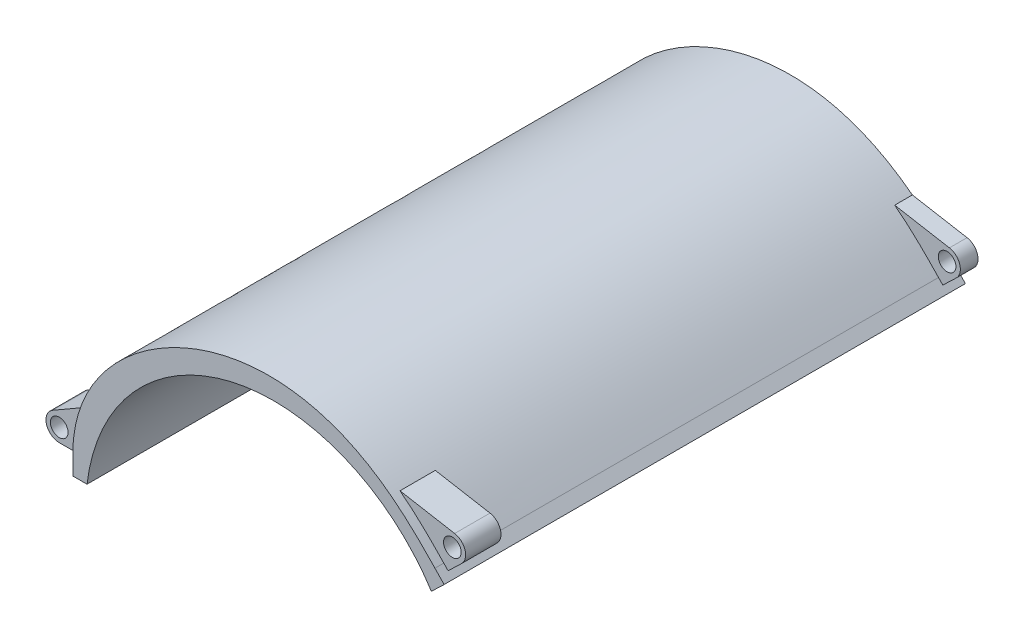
from build123d import *

# Parameters (mm, degrees)
BOSS_EXTRUDE1_DEPTH = 295
BOSS_EXTRUDE2_START = 285
SKETCH3_R           = 10
BOSS_EXTRUDE2_DEPTH = 40
BOSS_EXTRUDE3_START = -275
SKETCH3_4_R         = 10
BOSS_EXTRUDE3_DEPTH = 20


with BuildPart() as part:
    # Sketch1 → Boss-Extrude1 (new, symmetric)
    with BuildSketch(Plane.XY):
        with BuildLine():
            Line((-59.323974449, 128.759639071), (-73.741375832, 114.898234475))
            ThreePointArc((-73.741375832, 114.898234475), (-300.256584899, 207.064141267), (-463.524287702, 25))
            Line((-463.524287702, 25), (-479.524287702, 25))
            Line((-479.524287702, 25), (-479.524287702, 50))
            add(Edge.make_bspline(
                [(-69.720027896, 139.572690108), (-108.18754722, 179.583185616), (-152.416815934, 225.586540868), (-219.133886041, 251.435560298), (-287.408844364, 253.328836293), (-359.356081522, 236.563554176), (-477.15378099, 170.567422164), (-479.524287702, 50)],
                knots=[0, 0, 0, 0, 0, 0, 0, 0, 1, 1, 1, 1, 1, 1, 1, 1], degree=7))
            Line((-69.720027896, 139.572690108), (-59.323974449, 128.759639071))
        make_face()
    extrude(amount=BOSS_EXTRUDE1_DEPTH, both=True)

    # Sketch3 → Boss-Extrude2 (add)
    # profile 1 of 2: a face of its own
    with BuildSketch(Plane.XY.offset(BOSS_EXTRUDE2_START)):
        with BuildLine():
            Line((-505, 40), (-479.524287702, 40))
            Line((-479.524287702, 40), (-479.524287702, 50.000000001))
            add(Edge.make_bspline(
                [(-472.826933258, 90.89563682), (-474.51705784, 85.487785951), (-475.993797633, 79.937195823), (-477.239796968, 74.242499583), (-478.236465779, 68.402452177), (-478.963896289, 62.415949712), (-479.400774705, 56.282050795), (-479.524287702, 50.000000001)],
                knots=[0.947895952, 0.947895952, 0.947895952, 0.947895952, 0.947895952, 0.947895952, 0.947895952, 0.947895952, 1, 1, 1, 1, 1, 1, 1, 1], degree=7))
            Line((-472.826933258, 90.89563682), (-512.5, 67.990381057))
            ThreePointArc((-512.5, 67.990381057), (-519.488887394, 51.117714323), (-505, 40))
        make_face()
        with Locations((-505, 55)):
            Circle(SKETCH3_R, mode=Mode.SUBTRACT)
    # profile 2 of 2: a face of its own
    with BuildSketch(Plane.XY.offset(BOSS_EXTRUDE2_START)):
        with BuildLine():
            Line((-49.603946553, 149.186948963), (-64.860756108, 134.518507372))
            Line((-64.860756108, 134.518507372), (-69.720027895, 139.572690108))
            add(Edge.make_bspline(
                [(-69.720027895, 139.572690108), (-76.074149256, 146.181682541), (-82.585479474, 152.954189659), (-89.329402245, 159.772367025), (-96.35326765, 166.535005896), (-103.683856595, 173.155904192), (-111.333957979, 179.561593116), (-119.307330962, 185.688881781)],
                knots=[0, 0, 0, 0, 0, 0, 0, 0, 0.165181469, 0.165181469, 0.165181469, 0.165181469, 0.165181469, 0.165181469, 0.165181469, 0.165181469], degree=7))
            Line((-119.307330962, 185.688881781), (-57.395277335, 174.772116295))
            ThreePointArc((-57.395277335, 174.772116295), (-45.650601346, 164.369754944), (-49.603946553, 149.186948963))
        make_face()
        with Locations((-60, 160)):
            Circle(SKETCH3_R, mode=Mode.SUBTRACT)
    extrude(amount=-BOSS_EXTRUDE2_DEPTH)

    # Sketch3_4 → Boss-Extrude3 (add)
    # profile 1 of 2: a face of its own
    with BuildSketch(Plane.XY.offset(BOSS_EXTRUDE3_START)):
        with BuildLine():
            Line((-505, 40), (-479.524287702, 40))
            Line((-479.524287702, 40), (-479.524287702, 50.000000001))
            add(Edge.make_bspline(
                [(-472.826933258, 90.89563682), (-474.51705784, 85.487785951), (-475.993797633, 79.937195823), (-477.239796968, 74.242499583), (-478.236465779, 68.402452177), (-478.963896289, 62.415949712), (-479.400774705, 56.282050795), (-479.524287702, 50.000000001)],
                knots=[0.947895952, 0.947895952, 0.947895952, 0.947895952, 0.947895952, 0.947895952, 0.947895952, 0.947895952, 1, 1, 1, 1, 1, 1, 1, 1], degree=7))
            Line((-472.826933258, 90.89563682), (-512.5, 67.990381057))
            ThreePointArc((-512.5, 67.990381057), (-519.488887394, 51.117714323), (-505, 40))
        make_face()
        with Locations((-505, 55)):
            Circle(SKETCH3_4_R, mode=Mode.SUBTRACT)
    # profile 2 of 2: a face of its own
    with BuildSketch(Plane.XY.offset(BOSS_EXTRUDE3_START)):
        with BuildLine():
            Line((-49.603946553, 149.186948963), (-64.860756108, 134.518507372))
            Line((-64.860756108, 134.518507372), (-69.720027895, 139.572690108))
            add(Edge.make_bspline(
                [(-69.720027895, 139.572690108), (-76.074149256, 146.181682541), (-82.585479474, 152.954189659), (-89.329402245, 159.772367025), (-96.35326765, 166.535005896), (-103.683856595, 173.155904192), (-111.333957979, 179.561593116), (-119.307330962, 185.688881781)],
                knots=[0, 0, 0, 0, 0, 0, 0, 0, 0.165181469, 0.165181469, 0.165181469, 0.165181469, 0.165181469, 0.165181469, 0.165181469, 0.165181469], degree=7))
            Line((-119.307330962, 185.688881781), (-57.395277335, 174.772116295))
            ThreePointArc((-57.395277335, 174.772116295), (-45.650601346, 164.369754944), (-49.603946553, 149.186948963))
        make_face()
        with Locations((-60, 160)):
            Circle(SKETCH3_4_R, mode=Mode.SUBTRACT)
    extrude(amount=-BOSS_EXTRUDE3_DEPTH)


solid = part.part
